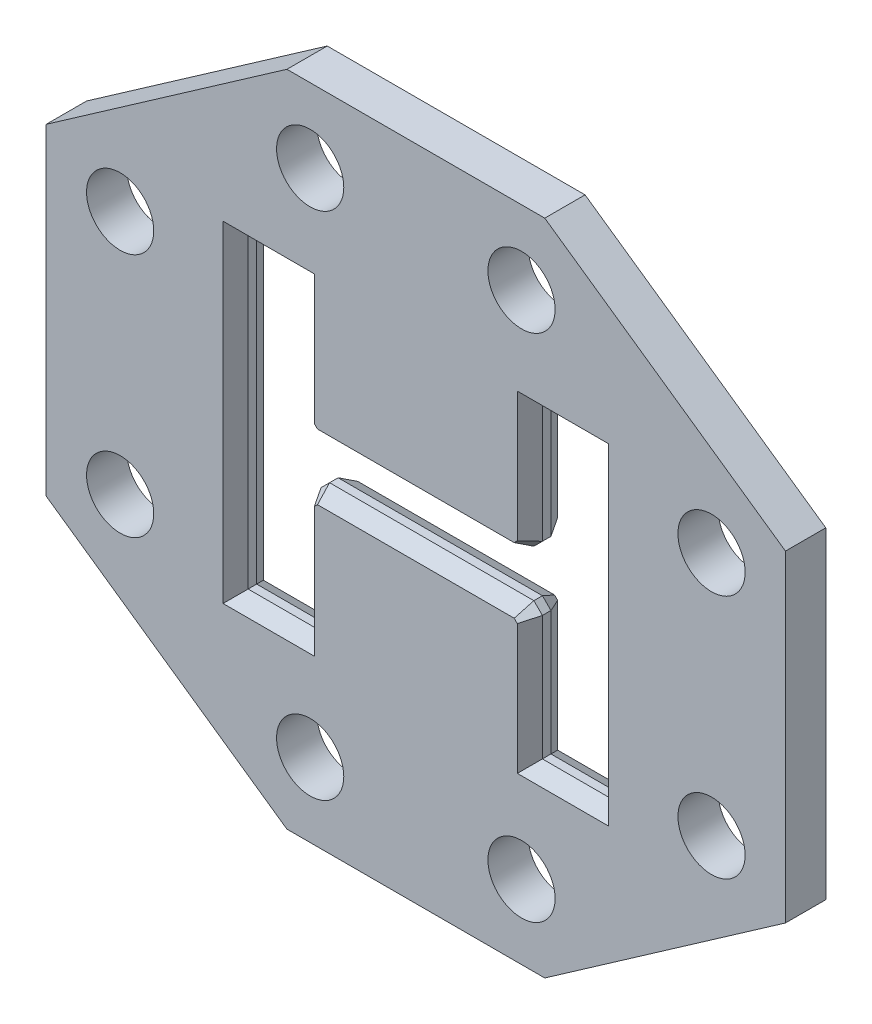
from build123d import *

# Parameters (mm, degrees)
MAIN_PLATE_DEPTH   = 28.575
SKETCH7_W          = 488.427889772
SKETCH7_H          = 597.424429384
EXTRUDE_W550_DEPTH = 28.575
HOLES_DEPTH        = 702.925349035
HOLES_DEPTH_BACK   = 702.925349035
SKETCH5_R          = 47.625
CHAMFER1_SIZE      = 13
CHAMFER1_SIZE2     = 22.516660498
CHAMFER2_SIZE      = 13
CHAMFER2_SIZE2     = 22.516660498


with BuildPart() as part:
    # Sketch3 → Main Plate (new, symmetric)
    with BuildSketch(Plane(origin=(0, 0, 0), x_dir=(0, 1, 0), z_dir=(0, 0, 1))):
        Polygon((228.234235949, 523.855268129), (466.324268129, 182.70492307), (466.324268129, -182.70492307), (228.234235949, -523.855268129), (-228.234235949, -523.855268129), (-466.324268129, -182.70492307), (-466.324268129, 182.70492307), (-228.234235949, 523.855268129), align=None)
        Polygon((-54.229, 156.845), (-230.378, 156.845), (-230.378, 287.909), (230.378, 287.909), (230.378, 156.845), (54.229, 156.845), (42.164, 144.78), (42.164, -144.78), (54.229, -156.845), (230.378, -156.845), (230.378, -287.909), (-230.378, -287.909), (-230.378, -156.845), (-54.229, -156.845), (-42.164, -144.78), (-42.164, 144.78), align=None, mode=Mode.SUBTRACT)
    extrude(amount=MAIN_PLATE_DEPTH, both=True)

    # Sketch7 → Extrude W550 (add, symmetric)
    with BuildSketch(Plane(origin=(0, 0, 0), x_dir=(0, 1, 0), z_dir=(0, 0, 1))):
        with Locations((1.882804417, 0.023527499)):
            Rectangle(SKETCH7_W, SKETCH7_H)
        Polygon((-45.466, 156.845), (-33.401, 144.78), (-33.401, -144.78), (-45.466, -156.845), (-221.615, -156.845), (-221.615, -260.223), (221.615, -260.223), (221.615, -156.845), (45.466, -156.845), (33.401, -144.78), (33.401, 144.78), (45.466, 156.845), (221.615, 156.845), (221.615, 260.223), (-221.615, 260.223), (-221.615, 156.845), align=None, mode=Mode.SUBTRACT)
    extrude(amount=EXTRUDE_W550_DEPTH, both=True)

    # Sketch5 → holes (cut, two sides: drawn at the far end of the back side and taken through both)
    with BuildSketch(Plane(origin=(0, 0, 0), x_dir=(0, 1, 0), z_dir=(0, 0, 1)).offset(-HOLES_DEPTH_BACK)):
        with Locations(Location((-173.588730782, 419.080268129, 0), (0, 0, 270))):
            Circle(SKETCH5_R)
        with Locations(Location((173.588730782, 419.080268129, 0), (0, 0, 270))):
            Circle(SKETCH5_R)
        with Locations(Location((361.549268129, 149.758610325, 0), (0, 0, 270))):
            Circle(SKETCH5_R)
        with Locations(Location((361.549268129, -149.758610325, 0), (0, 0, 270))):
            Circle(SKETCH5_R)
        with Locations(Location((173.588730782, -419.080268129, 0), (0, 0, 270))):
            Circle(SKETCH5_R)
        with Locations(Location((-173.588730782, -419.080268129, 0), (0, 0, 270))):
            Circle(SKETCH5_R)
        with Locations(Location((-361.549268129, -149.758610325, 0), (0, 0, 270))):
            Circle(SKETCH5_R)
        with Locations(Location((-361.549268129, 149.758610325, 0), (0, 0, 270))):
            Circle(SKETCH5_R)
    extrude(amount=HOLES_DEPTH + HOLES_DEPTH_BACK, mode=Mode.SUBTRACT)

    # Chamfer1
    chamfer1_edges = [part.edges().sort_by_distance(p)[0] for p in [
        (-208.534, 221.615, 28.575),
        (-260.223, 0, 28.575),
        (-208.534, -221.615, 28.575),
        (-150.8125, -39.4335, 28.575),
        (0, -33.401, 28.575),
        (150.8125, -39.4335, 28.575),
        (208.534, -221.615, 28.575),
        (260.223, 0, 28.575),
        (208.534, 221.615, 28.575),
        (150.8125, 39.4335, 28.575),
        (156.845, -133.5405, 28.575),
        (-156.845, 133.5405, 28.575),
        (-156.845, -133.5405, 28.575),
        (156.845, 133.5405, 28.575),
        (0, 33.401, 28.575),
        (-150.8125, 39.4335, 28.575),
    ]]
    chamfer1_side = [part.faces().sort_by_distance(p)[0] for p in [
        (-345.252406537, 335.776675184, 28.575),
    ]]
    chamfer(chamfer1_edges, length=CHAMFER1_SIZE, length2=CHAMFER1_SIZE2, reference=chamfer1_side[0])

    # Chamfer2
    chamfer2_edges = [part.edges().sort_by_distance(p)[0] for p in [
        (156.845, -133.5405, -28.575),
        (-156.845, 133.5405, -28.575),
        (-156.845, -133.5405, -28.575),
        (156.845, 133.5405, -28.575),
        (150.8125, 39.4335, -28.575),
        (0, 33.401, -28.575),
        (-150.8125, 39.4335, -28.575),
        (208.534, -221.615, -28.575),
        (260.223, 0, -28.575),
        (208.534, 221.615, -28.575),
        (-208.534, 221.615, -28.575),
        (-260.223, 0, -28.575),
        (-208.534, -221.615, -28.575),
        (-150.8125, -39.4335, -28.575),
        (0, -33.401, -28.575),
        (150.8125, -39.4335, -28.575),
    ]]
    chamfer2_side = [part.faces().sort_by_distance(p)[0] for p in [
        (-345.252406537, 335.776675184, -28.575),
    ]]
    chamfer(chamfer2_edges, length=CHAMFER2_SIZE, length2=CHAMFER2_SIZE2, reference=chamfer2_side[0])


solid = part.part
